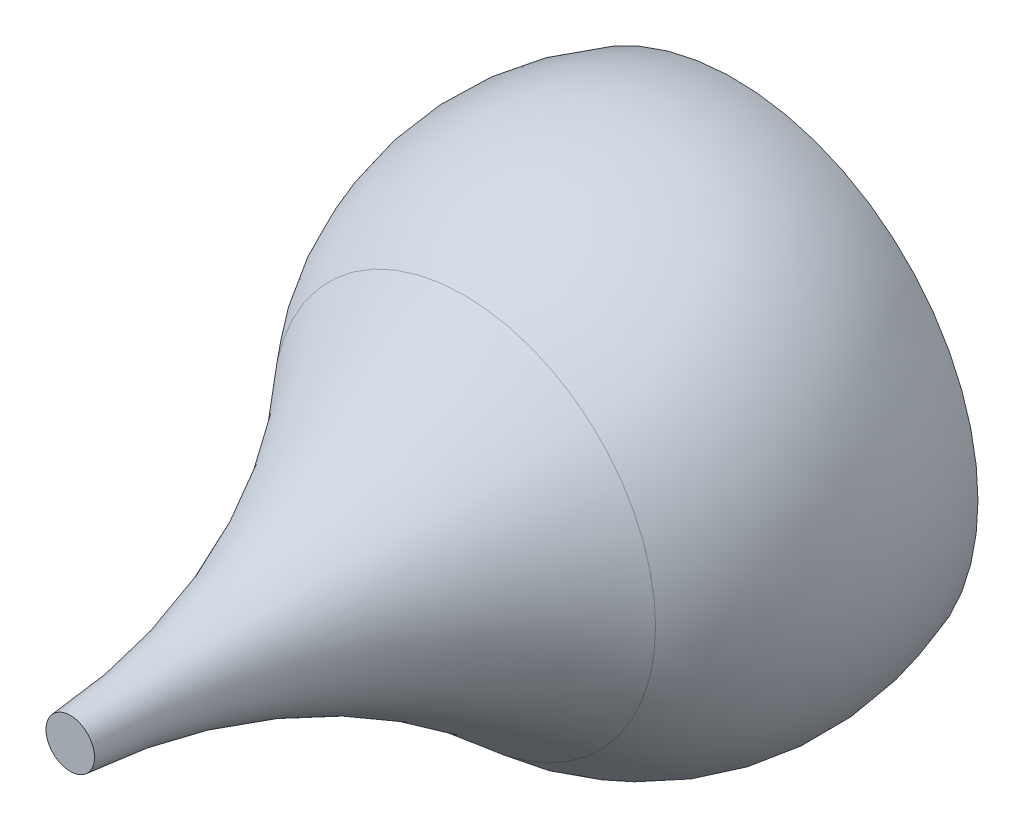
ISO-10303-21;
HEADER;
FILE_DESCRIPTION(('STEP AP214'),'2;1');
FILE_NAME('part.step','',(''),(''),'','','');
FILE_SCHEMA(('AUTOMOTIVE_DESIGN { 1 0 10303 214 1 1 1 1 }'));
ENDSEC;
DATA;
#1=APPLICATION_CONTEXT('core data for automotive mechanical design processes');
#2=APPLICATION_PROTOCOL_DEFINITION('international standard','automotive_design',2000,#1);
#3=PRODUCT_CONTEXT('',#1,'mechanical');
#4=PRODUCT('Part','Part','',(#3));
#5=PRODUCT_RELATED_PRODUCT_CATEGORY('part','',(#4));
#6=PRODUCT_DEFINITION_FORMATION('','',#4);
#7=PRODUCT_DEFINITION_CONTEXT('part definition',#1,'design');
#8=PRODUCT_DEFINITION('design','',#6,#7);
#9=PRODUCT_DEFINITION_SHAPE('','',#8);
#10=(LENGTH_UNIT() NAMED_UNIT(*) SI_UNIT(.MILLI.,.METRE.));
#11=(NAMED_UNIT(*) PLANE_ANGLE_UNIT() SI_UNIT($,.RADIAN.));
#12=(NAMED_UNIT(*) SI_UNIT($,.STERADIAN.) SOLID_ANGLE_UNIT());
#13=UNCERTAINTY_MEASURE_WITH_UNIT(LENGTH_MEASURE(1.E-05),#10,'distance_accuracy_value','');
#14=(GEOMETRIC_REPRESENTATION_CONTEXT(3) GLOBAL_UNCERTAINTY_ASSIGNED_CONTEXT((#13)) GLOBAL_UNIT_ASSIGNED_CONTEXT((#10,
#11,#12)) REPRESENTATION_CONTEXT('',''));
#15=CARTESIAN_POINT('',(0.,0.,0.));
#16=DIRECTION('',(0.,0.,1.));
#17=DIRECTION('',(1.,0.,0.));
#18=AXIS2_PLACEMENT_3D('',#15,#16,#17);
#19=CARTESIAN_POINT('',(0.,44.1000000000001,-40.5));
#20=DIRECTION('',(0.,0.,-1.));
#21=DIRECTION('',(0.,1.,0.));
#22=AXIS2_PLACEMENT_3D('',#19,#20,#21);
#23=PLANE('',#22);
#24=CARTESIAN_POINT('',(0.,44.1000000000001,-40.5));
#25=DIRECTION('',(0.,0.,-1.));
#26=DIRECTION('',(0.,1.,0.));
#27=AXIS2_PLACEMENT_3D('',#24,#25,#26);
#28=CIRCLE('',#27,20.75);
#29=CARTESIAN_POINT('',(0.,64.8500000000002,-40.4999999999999));
#30=VERTEX_POINT('',#29);
#31=EDGE_CURVE('E59',#30,#30,#28,.T.);
#32=ORIENTED_EDGE('',*,*,#31,.F.);
#33=EDGE_LOOP('',(#32));
#34=FACE_BOUND('',#33,.T.);
#35=ADVANCED_FACE('F53',(#34),#23,.F.);
#36=CARTESIAN_POINT('',(0.,44.1000000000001,-42.3));
#37=DIRECTION('',(0.,0.,1.));
#38=DIRECTION('',(0.,-1.,0.));
#39=AXIS2_PLACEMENT_3D('',#36,#37,#38);
#40=PLANE('',#39);
#41=CARTESIAN_POINT('',(0.,44.1000000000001,-42.3));
#42=DIRECTION('',(0.,0.,-1.));
#43=DIRECTION('',(0.,1.,0.));
#44=AXIS2_PLACEMENT_3D('',#41,#42,#43);
#45=CIRCLE('',#44,20.75);
#46=CARTESIAN_POINT('',(0.,64.8500000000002,-42.2999999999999));
#47=VERTEX_POINT('',#46);
#48=EDGE_CURVE('E11',#47,#47,#45,.T.);
#49=ORIENTED_EDGE('',*,*,#48,.T.);
#50=EDGE_LOOP('',(#49));
#51=FACE_BOUND('',#50,.T.);
#52=ADVANCED_FACE('F68',(#51),#40,.F.);
#53=CARTESIAN_POINT('',(0.,44.1000000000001,-44.1));
#54=DIRECTION('',(0.,0.,-1.));
#55=DIRECTION('',(0.,1.,0.));
#56=AXIS2_PLACEMENT_3D('',#53,#54,#55);
#57=CYLINDRICAL_SURFACE('',#56,20.75);
#58=ORIENTED_EDGE('',*,*,#48,.F.);
#59=EDGE_LOOP('',(#58));
#60=FACE_BOUND('',#59,.T.);
#61=ORIENTED_EDGE('',*,*,#31,.T.);
#62=EDGE_LOOP('',(#61));
#63=FACE_BOUND('',#62,.T.);
#64=ADVANCED_FACE('F65',(#60,#63),#57,.T.);
#65=CLOSED_SHELL('',(#35,#52,#64));
#66=MANIFOLD_SOLID_BREP('B2_NOT_SHOWN',#65);
#67=CARTESIAN_POINT('',(0.,44.1000000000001,-44.1));
#68=DIRECTION('',(0.,0.,1.));
#69=DIRECTION('',(0.,-1.,0.));
#70=AXIS2_PLACEMENT_3D('',#67,#68,#69);
#71=PLANE('',#70);
#72=CARTESIAN_POINT('',(0.,44.1000000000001,-44.1));
#73=DIRECTION('',(0.,0.,-1.));
#74=DIRECTION('',(0.,1.,0.));
#75=AXIS2_PLACEMENT_3D('',#72,#73,#74);
#76=CIRCLE('',#75,62.6711503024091);
#77=CARTESIAN_POINT('',(62.6711503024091,44.1000000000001,-44.1));
#78=VERTEX_POINT('',#77);
#79=EDGE_CURVE('E156',#78,#78,#76,.T.);
#80=ORIENTED_EDGE('',*,*,#79,.T.);
#81=EDGE_LOOP('',(#80));
#82=FACE_BOUND('',#81,.T.);
#83=ADVANCED_FACE('F95',(#82),#71,.F.);
#84=CARTESIAN_POINT('',(0.,44.1000000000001,-20.1));
#85=DIRECTION('',(0.,0.,-1.));
#86=DIRECTION('',(1.,0.,0.));
#87=AXIS2_PLACEMENT_3D('',#84,#85,#86);
#88=SPHERICAL_SURFACE('',#87,67.1094112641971);
#89=CARTESIAN_POINT('',(0.,44.0999999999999,25.4824997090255));
#90=DIRECTION('',(0.,0.,-1.));
#91=DIRECTION('',(0.,1.,0.));
#92=AXIS2_PLACEMENT_3D('',#89,#90,#91);
#93=CIRCLE('',#92,49.253515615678);
#94=CARTESIAN_POINT('',(49.253515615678,44.0999999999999,25.4824997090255));
#95=VERTEX_POINT('',#94);
#96=EDGE_CURVE('E153',#95,#95,#93,.T.);
#97=CARTESIAN_POINT('',(62.6711503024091,44.1000000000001,-44.1));
#98=CARTESIAN_POINT('',(62.9492637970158,44.1000000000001,-43.3737792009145));
#99=CARTESIAN_POINT('',(63.2147433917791,44.1000000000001,-42.6427206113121));
#100=CARTESIAN_POINT('',(63.720138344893,44.1000000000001,-41.1718196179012));
#101=CARTESIAN_POINT('',(63.9600537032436,44.1000000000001,-40.4319772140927));
#102=CARTESIAN_POINT('',(64.4140237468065,44.1000000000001,-38.9444003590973));
#103=CARTESIAN_POINT('',(64.6280784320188,44.1000000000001,-38.1966659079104));
#104=CARTESIAN_POINT('',(65.0300702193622,44.1000000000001,-36.6942091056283));
#105=CARTESIAN_POINT('',(65.2180073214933,44.1000000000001,-35.939486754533));
#106=CARTESIAN_POINT('',(65.5675363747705,44.1000000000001,-34.4239659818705));
#107=CARTESIAN_POINT('',(65.7291283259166,44.1000000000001,-33.6631675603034));
#108=CARTESIAN_POINT('',(66.0257719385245,44.1000000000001,-32.1364140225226));
#109=CARTESIAN_POINT('',(66.1608235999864,44.1000000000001,-31.370458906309));
#110=CARTESIAN_POINT('',(66.404223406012,44.1000000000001,-29.8343175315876));
#111=CARTESIAN_POINT('',(66.5125715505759,44.1000000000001,-29.0641312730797));
#112=CARTESIAN_POINT('',(66.7024334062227,44.1000000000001,-27.5204582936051));
#113=CARTESIAN_POINT('',(66.7839471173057,44.1000000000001,-26.7469715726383));
#114=CARTESIAN_POINT('',(66.9200416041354,44.1000000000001,-25.1976323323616));
#115=CARTESIAN_POINT('',(66.9746223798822,44.1000000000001,-24.4217798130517));
#116=CARTESIAN_POINT('',(67.0567850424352,44.1000000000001,-22.8686465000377));
#117=CARTESIAN_POINT('',(67.0843669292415,44.1000000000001,-22.0913657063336));
#118=CARTESIAN_POINT('',(67.1124984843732,44.1000000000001,-20.5363150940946));
#119=CARTESIAN_POINT('',(67.1130481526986,44.1000000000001,-19.7585452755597));
#120=CARTESIAN_POINT('',(67.0871146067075,44.1000000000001,-18.2034564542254));
#121=CARTESIAN_POINT('',(67.060631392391,44.1000000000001,-17.426137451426));
#122=CARTESIAN_POINT('',(66.980664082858,44.1000000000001,-15.8728895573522));
#123=CARTESIAN_POINT('',(66.9271799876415,44.1,-15.0969606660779));
#124=CARTESIAN_POINT('',(66.793275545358,44.1,-13.5474306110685));
#125=CARTESIAN_POINT('',(66.712855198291,44.1,-12.7738294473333));
#126=CARTESIAN_POINT('',(66.525175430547,44.1,-11.2298896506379));
#127=CARTESIAN_POINT('',(66.41791600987,44.1,-10.4595510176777));
#128=CARTESIAN_POINT('',(66.1766877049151,44.1,-8.92306714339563));
#129=CARTESIAN_POINT('',(66.0427188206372,44.1,-8.15692190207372));
#130=CARTESIAN_POINT('',(65.7482334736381,44.1,-6.62975060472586));
#131=CARTESIAN_POINT('',(65.587717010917,44.1,-5.86872454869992));
#132=CARTESIAN_POINT('',(65.2403304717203,44.1,-4.35271122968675));
#133=CARTESIAN_POINT('',(65.0534603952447,44.1,-3.59772396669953));
#134=CARTESIAN_POINT('',(64.6535924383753,44.1,-2.09470054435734));
#135=CARTESIAN_POINT('',(64.4405945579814,44.1,-1.34666438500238));
#136=CARTESIAN_POINT('',(63.9887283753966,44.1,0.141552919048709));
#137=CARTESIAN_POINT('',(63.7498600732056,44.1,0.881734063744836));
#138=CARTESIAN_POINT('',(63.2465416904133,44.1,2.35334691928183));
#139=CARTESIAN_POINT('',(62.9820916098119,44.1,3.0847786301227));
#140=CARTESIAN_POINT('',(62.4279292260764,44.1,4.53800877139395));
#141=CARTESIAN_POINT('',(62.1382169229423,44.1,5.25980720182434));
#142=CARTESIAN_POINT('',(61.5338801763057,44.1,6.69289857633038));
#143=CARTESIAN_POINT('',(61.2192557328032,44.1,7.40419152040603));
#144=CARTESIAN_POINT('',(60.5654748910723,44.1,8.81541241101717));
#145=CARTESIAN_POINT('',(60.2263184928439,44.1,9.51534035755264));
#146=CARTESIAN_POINT('',(59.52388357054,44.1,10.9029854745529));
#147=CARTESIAN_POINT('',(59.1606050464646,44.1,11.5907026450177));
#148=CARTESIAN_POINT('',(58.4103648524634,44.1,12.953095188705));
#149=CARTESIAN_POINT('',(58.0234031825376,44.0999999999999,13.6277705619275));
#150=CARTESIAN_POINT('',(57.2262642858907,44.0999999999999,14.9632642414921));
#151=CARTESIAN_POINT('',(56.8160870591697,44.0999999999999,15.6240825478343));
#152=CARTESIAN_POINT('',(55.9730127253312,44.0999999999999,16.9310635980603));
#153=CARTESIAN_POINT('',(55.5401156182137,44.0999999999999,17.5772263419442));
#154=CARTESIAN_POINT('',(54.6521245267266,44.0999999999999,18.8541153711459));
#155=CARTESIAN_POINT('',(54.1970305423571,44.0999999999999,19.4848416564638));
#156=CARTESIAN_POINT('',(53.2651959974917,44.0999999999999,20.7300959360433));
#157=CARTESIAN_POINT('',(52.7884554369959,44.0999999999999,21.3446239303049));
#158=CARTESIAN_POINT('',(51.8139024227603,44.0999999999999,22.5567378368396));
#159=CARTESIAN_POINT('',(51.3160899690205,44.0999999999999,23.1543237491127));
#160=CARTESIAN_POINT('',(50.2999999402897,44.0999999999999,24.3318358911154));
#161=CARTESIAN_POINT('',(49.7817223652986,44.0999999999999,24.9117621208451));
#162=CARTESIAN_POINT('',(49.253515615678,44.0999999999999,25.4824997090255));
#163=B_SPLINE_CURVE_WITH_KNOTS('',3,(#97,#98,#99,#100,#101,#102,#103,#104,#105,#106,#107,#108,
#109,#110,#111,#112,#113,#114,#115,#116,#117,#118,#119,#120,#121,#122,#123,#124,#125,#126,#127,
#128,#129,#130,#131,#132,#133,#134,#135,#136,#137,#138,#139,#140,#141,#142,#143,#144,#145,#146,
#147,#148,#149,#150,#151,#152,#153,#154,#155,#156,#157,#158,#159,#160,#161,#162),.UNSPECIFIED.,
.F.,.F.,(4,2,2,2,2,2,2,2,2,2,2,2,2,2,2,2,2,2,2,2,2,2,2,2,2,2,2,2,2,2,2,2,4),(0.,
2.33284011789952,4.66568023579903,6.99852035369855,9.33136047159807,11.6642005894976,
13.9970407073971,16.3298808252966,18.6627209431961,20.9955610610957,23.3284011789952,
25.6612412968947,27.9940814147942,30.3269215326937,32.6597616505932,34.9926017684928,
37.3254418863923,39.6582820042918,41.9911221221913,44.3239622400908,46.6568023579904,
48.9896424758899,51.3224825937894,53.6553227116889,55.9881628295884,58.3210029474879,
60.6538430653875,62.986683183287,65.3195233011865,67.652363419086,69.9852035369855,
72.3180436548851,74.6508837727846),.UNSPECIFIED.);
#164=EDGE_CURVE('BSEAM136',#78,#95,#163,.T.);
#165=ORIENTED_EDGE('',*,*,#79,.F.);
#166=ORIENTED_EDGE('',*,*,#96,.T.);
#167=ORIENTED_EDGE('',*,*,#164,.T.);
#168=ORIENTED_EDGE('',*,*,#164,.F.);
#169=EDGE_LOOP('',(#165,#167,#166,#168));
#170=FACE_BOUND('',#169,.T.);
#171=ADVANCED_FACE('F136',(#170),#88,.T.);
#172=CARTESIAN_POINT('',(0.,44.0999999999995,135.9));
#173=DIRECTION('',(0.,0.,-1.));
#174=DIRECTION('',(0.,1.,0.));
#175=AXIS2_PLACEMENT_3D('',#172,#173,#174);
#176=TOROIDAL_SURFACE('',#175,168.563560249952,162.563560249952);
#177=CARTESIAN_POINT('',(0.,44.0999999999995,126.9));
#178=DIRECTION('',(0.,0.,-1.));
#179=DIRECTION('',(0.,1.,0.));
#180=AXIS2_PLACEMENT_3D('',#177,#178,#179);
#181=CIRCLE('',#180,6.24932451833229);
#182=CARTESIAN_POINT('',(0.,50.3493245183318,126.9));
#183=VERTEX_POINT('',#182);
#184=EDGE_CURVE('E152',#183,#183,#181,.T.);
#185=ORIENTED_EDGE('',*,*,#184,.T.);
#186=EDGE_LOOP('',(#185));
#187=FACE_BOUND('',#186,.T.);
#188=ORIENTED_EDGE('',*,*,#96,.F.);
#189=EDGE_LOOP('',(#188));
#190=FACE_BOUND('',#189,.T.);
#191=ADVANCED_FACE('F140',(#187,#190),#176,.F.);
#192=CARTESIAN_POINT('',(0.,44.0999999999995,126.9));
#193=DIRECTION('',(0.,0.,-1.));
#194=DIRECTION('',(0.,1.,0.));
#195=AXIS2_PLACEMENT_3D('',#192,#193,#194);
#196=PLANE('',#195);
#197=ORIENTED_EDGE('',*,*,#184,.F.);
#198=EDGE_LOOP('',(#197));
#199=FACE_BOUND('',#198,.T.);
#200=ADVANCED_FACE('F144',(#199),#196,.F.);
#201=CLOSED_SHELL('',(#83,#171,#191,#200));
#202=CARTESIAN_POINT('',(0.,44.0999999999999,27.6217817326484));
#203=DIRECTION('',(0.,0.,-1.));
#204=DIRECTION('',(0.,1.,0.));
#205=AXIS2_PLACEMENT_3D('',#202,#203,#204);
#206=CONICAL_SURFACE('',#205,39.3757075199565,0.697571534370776);
#207=CARTESIAN_POINT('',(0.,44.0999999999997,74.6013422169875));
#208=VERTEX_POINT('',#207);
#209=VERTEX_LOOP('',#208);
#210=FACE_BOUND('',#209,.T.);
#211=CARTESIAN_POINT('',(0.,44.0999999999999,27.6217817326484));
#212=DIRECTION('',(0.,0.,-1.));
#213=DIRECTION('',(0.,1.,0.));
#214=AXIS2_PLACEMENT_3D('',#211,#212,#213);
#215=CIRCLE('',#214,39.3757075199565);
#216=CARTESIAN_POINT('',(0.,83.4757075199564,27.6217817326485));
#217=VERTEX_POINT('',#216);
#218=EDGE_CURVE('E51',#217,#217,#215,.T.);
#219=ORIENTED_EDGE('',*,*,#218,.T.);
#220=EDGE_LOOP('',(#219));
#221=FACE_BOUND('',#220,.T.);
#222=ADVANCED_FACE('F97',(#210,#221),#206,.F.);
#223=CARTESIAN_POINT('',(0.,44.0999999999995,135.9));
#224=DIRECTION('',(0.,0.,-1.));
#225=DIRECTION('',(0.,1.,0.));
#226=AXIS2_PLACEMENT_3D('',#223,#224,#225);
#227=TOROIDAL_SURFACE('',#226,168.563560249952,168.563560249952);
#228=CARTESIAN_POINT('',(0.,44.0999999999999,21.4071398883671));
#229=DIRECTION('',(0.,0.,-1.));
#230=DIRECTION('',(0.,1.,0.));
#231=AXIS2_PLACEMENT_3D('',#228,#229,#230);
#232=CIRCLE('',#231,44.8499440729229);
#233=CARTESIAN_POINT('',(44.8499440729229,44.0999999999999,21.4071398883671));
#234=VERTEX_POINT('',#233);
#235=EDGE_CURVE('E103',#234,#234,#232,.T.);
#236=ORIENTED_EDGE('',*,*,#235,.T.);
#237=EDGE_LOOP('',(#236));
#238=FACE_BOUND('',#237,.T.);
#239=ORIENTED_EDGE('',*,*,#218,.F.);
#240=EDGE_LOOP('',(#239));
#241=FACE_BOUND('',#240,.T.);
#242=ADVANCED_FACE('F108',(#238,#241),#227,.T.);
#243=CARTESIAN_POINT('',(0.,44.1000000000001,-20.1));
#244=DIRECTION('',(0.,0.,-1.));
#245=DIRECTION('',(1.,0.,0.));
#246=AXIS2_PLACEMENT_3D('',#243,#244,#245);
#247=SPHERICAL_SURFACE('',#246,61.1094112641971);
#248=CARTESIAN_POINT('',(0.,44.1000000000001,-40.4999999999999));
#249=DIRECTION('',(0.,0.,-1.));
#250=DIRECTION('',(0.,1.,0.));
#251=AXIS2_PLACEMENT_3D('',#248,#249,#250);
#252=CIRCLE('',#251,57.6038205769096);
#253=CARTESIAN_POINT('',(57.6038205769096,44.1000000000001,-40.4999999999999));
#254=VERTEX_POINT('',#253);
#255=EDGE_CURVE('E167',#254,#254,#252,.T.);
#256=CARTESIAN_POINT('',(44.8499440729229,44.0999999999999,21.4071398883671));
#257=CARTESIAN_POINT('',(45.319959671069,44.0999999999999,20.899278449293));
#258=CARTESIAN_POINT('',(45.7813417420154,44.0999999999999,20.383427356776));
#259=CARTESIAN_POINT('',(46.6863226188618,44.0999999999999,19.3363550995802));
#260=CARTESIAN_POINT('',(47.1299214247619,44.0999999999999,18.8051339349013));
#261=CARTESIAN_POINT('',(47.998819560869,44.0999999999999,17.7279307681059));
#262=CARTESIAN_POINT('',(48.4241188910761,44.0999999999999,17.1819487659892));
#263=CARTESIAN_POINT('',(49.2559284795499,44.0999999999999,16.0758549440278));
#264=CARTESIAN_POINT('',(49.6624387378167,44.0999999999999,15.5157431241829));
#265=CARTESIAN_POINT('',(50.456200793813,44.0999999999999,14.3820357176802));
#266=CARTESIAN_POINT('',(50.8434525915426,44.0999999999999,13.8084401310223));
#267=CARTESIAN_POINT('',(51.5982509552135,44.0999999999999,12.6484271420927));
#268=CARTESIAN_POINT('',(51.9657975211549,44.1,12.0620097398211));
#269=CARTESIAN_POINT('',(52.6807612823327,44.1,10.8770297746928));
#270=CARTESIAN_POINT('',(53.0281784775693,44.1,10.2784672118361));
#271=CARTESIAN_POINT('',(53.7024826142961,44.1,9.06988761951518));
#272=CARTESIAN_POINT('',(54.0293695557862,44.1,8.45987059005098));
#273=CARTESIAN_POINT('',(54.6622359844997,44.1,7.22908596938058));
#274=CARTESIAN_POINT('',(54.968215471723,44.1,6.60831837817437));
#275=CARTESIAN_POINT('',(55.5589139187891,44.1,5.35674894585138));
#276=CARTESIAN_POINT('',(55.843632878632,44.1,4.72594710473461));
#277=CARTESIAN_POINT('',(56.391481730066,44.1,3.45503706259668));
#278=CARTESIAN_POINT('',(56.6546116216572,44.1,2.81492886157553));
#279=CARTESIAN_POINT('',(57.1589787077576,44.1,1.52614472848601));
#280=CARTESIAN_POINT('',(57.4002159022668,44.1,0.877468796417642));
#281=CARTESIAN_POINT('',(57.8605192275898,44.1,-0.427702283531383));
#282=CARTESIAN_POINT('',(58.0795853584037,44.1,-1.08419743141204));
#283=CARTESIAN_POINT('',(58.4952937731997,44.1,-2.40424940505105));
#284=CARTESIAN_POINT('',(58.691936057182,44.1,-3.06780623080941));
#285=CARTESIAN_POINT('',(59.0625698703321,44.1,-4.40121587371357));
#286=CARTESIAN_POINT('',(59.2365613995,44.1,-5.07106869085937));
#287=CARTESIAN_POINT('',(59.5616929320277,44.1,-6.41629736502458));
#288=CARTESIAN_POINT('',(59.7128329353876,44.1,-7.09167322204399));
#289=CARTESIAN_POINT('',(59.9920870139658,44.1,-8.44716865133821));
#290=CARTESIAN_POINT('',(60.1202010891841,44.1,-9.12728822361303));
#291=CARTESIAN_POINT('',(60.3532554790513,44.1,-10.4914862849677));
#292=CARTESIAN_POINT('',(60.4581957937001,44.1,-11.1755647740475));
#293=CARTESIAN_POINT('',(60.6447815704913,44.1,-12.5468913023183));
#294=CARTESIAN_POINT('',(60.7264270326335,44.1,-13.2341393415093));
#295=CARTESIAN_POINT('',(60.866328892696,44.1,-14.6110119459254));
#296=CARTESIAN_POINT('',(60.9245852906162,44.1000000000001,-15.3006365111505));
#297=CARTESIAN_POINT('',(61.0176417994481,44.1000000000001,-16.6814664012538));
#298=CARTESIAN_POINT('',(61.0524419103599,44.1000000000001,-17.372671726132));
#299=CARTESIAN_POINT('',(61.0985456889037,44.1000000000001,-18.7558655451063));
#300=CARTESIAN_POINT('',(61.1098493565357,44.1000000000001,-19.4478540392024));
#301=CARTESIAN_POINT('',(61.1089472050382,44.1000000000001,-20.831815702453));
#302=CARTESIAN_POINT('',(61.0967413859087,44.1000000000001,-21.5237888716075));
#303=CARTESIAN_POINT('',(61.0488343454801,44.1000000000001,-22.9069214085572));
#304=CARTESIAN_POINT('',(61.0131331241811,44.1000000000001,-23.5980807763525));
#305=CARTESIAN_POINT('',(60.9182764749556,44.1000000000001,-24.9787881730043));
#306=CARTESIAN_POINT('',(60.8591210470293,44.1000000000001,-25.6683362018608));
#307=CARTESIAN_POINT('',(60.7174242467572,44.1000000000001,-27.0450252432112));
#308=CARTESIAN_POINT('',(60.6348828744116,44.1000000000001,-27.7321662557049));
#309=CARTESIAN_POINT('',(60.4465094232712,44.1000000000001,-29.103248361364));
#310=CARTESIAN_POINT('',(60.3406773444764,44.1000000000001,-29.7871894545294));
#311=CARTESIAN_POINT('',(60.105844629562,44.1000000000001,-31.1510825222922));
#312=CARTESIAN_POINT('',(59.9768439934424,44.1000000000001,-31.8310344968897));
#313=CARTESIAN_POINT('',(59.6958229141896,44.1000000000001,-33.1861646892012));
#314=CARTESIAN_POINT('',(59.5438024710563,44.1000000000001,-33.8613429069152));
#315=CARTESIAN_POINT('',(59.2169175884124,44.1000000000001,-35.2061466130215));
#316=CARTESIAN_POINT('',(59.0420531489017,44.1000000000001,-35.8757721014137));
#317=CARTESIAN_POINT('',(58.66968058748,44.1000000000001,-37.2086971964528));
#318=CARTESIAN_POINT('',(58.472172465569,44.1000000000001,-37.8719968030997));
#319=CARTESIAN_POINT('',(58.0547459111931,44.1000000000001,-39.1915064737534));
#320=CARTESIAN_POINT('',(57.8348274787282,44.1000000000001,-39.8477165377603));
#321=CARTESIAN_POINT('',(57.6038205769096,44.1000000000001,-40.4999999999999));
#322=B_SPLINE_CURVE_WITH_KNOTS('',3,(#256,#257,#258,#259,#260,#261,#262,#263,#264,#265,#266,
#267,#268,#269,#270,#271,#272,#273,#274,#275,#276,#277,#278,#279,#280,#281,#282,#283,#284,#285,
#286,#287,#288,#289,#290,#291,#292,#293,#294,#295,#296,#297,#298,#299,#300,#301,#302,#303,#304,
#305,#306,#307,#308,#309,#310,#311,#312,#313,#314,#315,#316,#317,#318,#319,#320,#321),
.UNSPECIFIED.,.F.,.F.,(4,2,2,2,2,2,2,2,2,2,2,2,2,2,2,2,2,2,2,2,2,2,2,2,2,2,2,2,2,2,2,2,4),(0.,
2.0758431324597,4.1516862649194,6.2275293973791,8.3033725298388,10.3792156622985,
12.4550587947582,14.5309019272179,16.6067450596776,18.6825881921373,20.758431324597,
22.8342744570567,24.9101175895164,26.9859607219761,29.0618038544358,31.1376469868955,
33.2134901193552,35.2893332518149,37.3651763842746,39.4410195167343,41.516862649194,
43.5927057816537,45.6685489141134,47.7443920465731,49.8202351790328,51.8960783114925,
53.9719214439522,56.0477645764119,58.1236077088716,60.1994508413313,62.275293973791,
64.3511371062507,66.4269802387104),.UNSPECIFIED.);
#323=EDGE_CURVE('BSEAM113',#234,#254,#322,.T.);
#324=ORIENTED_EDGE('',*,*,#235,.F.);
#325=ORIENTED_EDGE('',*,*,#255,.T.);
#326=ORIENTED_EDGE('',*,*,#323,.T.);
#327=ORIENTED_EDGE('',*,*,#323,.F.);
#328=EDGE_LOOP('',(#324,#326,#325,#327));
#329=FACE_BOUND('',#328,.T.);
#330=ADVANCED_FACE('F113',(#329),#247,.F.);
#331=CARTESIAN_POINT('',(0.,44.1000000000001,-40.4999999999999));
#332=DIRECTION('',(0.,0.,-1.));
#333=DIRECTION('',(0.,1.,0.));
#334=AXIS2_PLACEMENT_3D('',#331,#332,#333);
#335=PLANE('',#334);
#336=ORIENTED_EDGE('',*,*,#255,.F.);
#337=EDGE_LOOP('',(#336));
#338=FACE_BOUND('',#337,.T.);
#339=CARTESIAN_POINT('',(0.,44.1000000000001,-40.5));
#340=DIRECTION('',(0.,0.,-1.));
#341=DIRECTION('',(0.,1.,0.));
#342=AXIS2_PLACEMENT_3D('',#339,#340,#341);
#343=CIRCLE('',#342,20.75);
#344=CARTESIAN_POINT('',(0.,64.8500000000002,-40.4999999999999));
#345=VERTEX_POINT('',#344);
#346=EDGE_CURVE('E164',#345,#345,#343,.T.);
#347=ORIENTED_EDGE('',*,*,#346,.T.);
#348=EDGE_LOOP('',(#347));
#349=FACE_BOUND('',#348,.T.);
#350=ADVANCED_FACE('F118',(#338,#349),#335,.F.);
#351=CARTESIAN_POINT('',(0.,44.1000000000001,-35.75));
#352=DIRECTION('',(0.,0.,-1.));
#353=DIRECTION('',(0.,1.,0.));
#354=AXIS2_PLACEMENT_3D('',#351,#352,#353);
#355=CYLINDRICAL_SURFACE('',#354,20.75);
#356=CARTESIAN_POINT('',(0.,44.1000000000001,-42.3));
#357=DIRECTION('',(0.,0.,-1.));
#358=DIRECTION('',(0.,1.,0.));
#359=AXIS2_PLACEMENT_3D('',#356,#357,#358);
#360=CIRCLE('',#359,20.75);
#361=CARTESIAN_POINT('',(0.,64.8500000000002,-42.2999999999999));
#362=VERTEX_POINT('',#361);
#363=EDGE_CURVE('E161',#362,#362,#360,.T.);
#364=ORIENTED_EDGE('',*,*,#363,.T.);
#365=EDGE_LOOP('',(#364));
#366=FACE_BOUND('',#365,.T.);
#367=ORIENTED_EDGE('',*,*,#346,.F.);
#368=EDGE_LOOP('',(#367));
#369=FACE_BOUND('',#368,.T.);
#370=ADVANCED_FACE('F125',(#366,#369),#355,.F.);
#371=CARTESIAN_POINT('',(0.,44.1000000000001,-42.3));
#372=DIRECTION('',(0.,0.,1.));
#373=DIRECTION('',(0.,-1.,0.));
#374=AXIS2_PLACEMENT_3D('',#371,#372,#373);
#375=PLANE('',#374);
#376=ORIENTED_EDGE('',*,*,#363,.F.);
#377=EDGE_LOOP('',(#376));
#378=FACE_BOUND('',#377,.T.);
#379=ADVANCED_FACE('F129',(#378),#375,.T.);
#380=CLOSED_SHELL('',(#222,#242,#330,#350,#370,#379));
#381=ORIENTED_CLOSED_SHELL('',*,#380,.T.);
#382=BREP_WITH_VOIDS('B6',#201,(#381));
#383=ADVANCED_BREP_SHAPE_REPRESENTATION('',(#18,#66,#382),#14);
#384=SHAPE_DEFINITION_REPRESENTATION(#9,#383);
ENDSEC;
END-ISO-10303-21;
